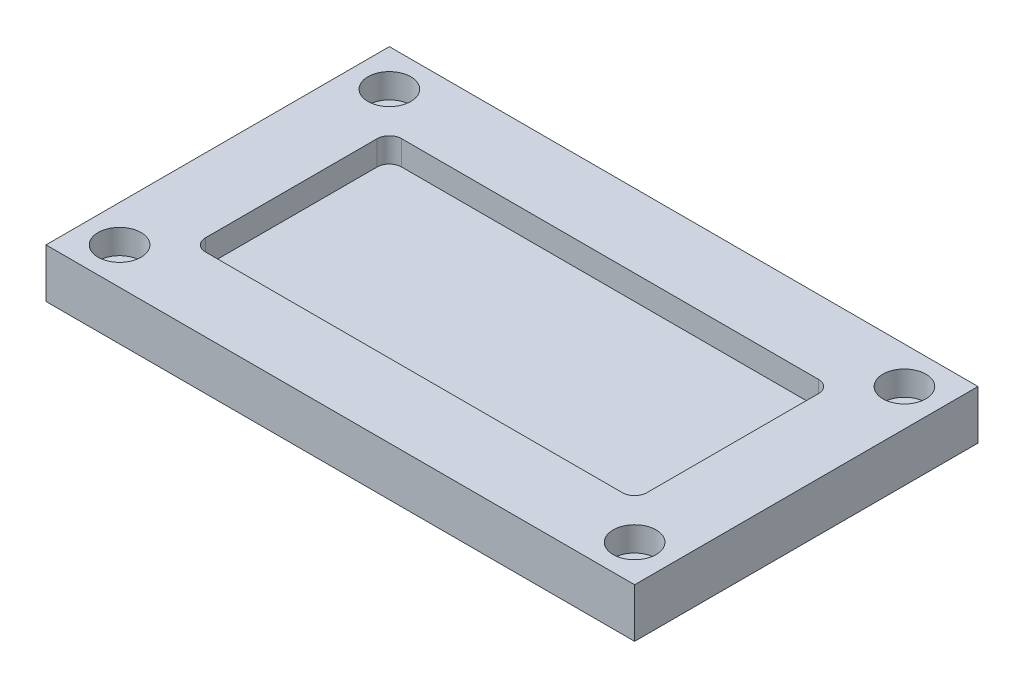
ISO-10303-21;
HEADER;
FILE_DESCRIPTION(('STEP AP214'),'2;1');
FILE_NAME('part.step','',(''),(''),'','','');
FILE_SCHEMA(('AUTOMOTIVE_DESIGN { 1 0 10303 214 1 1 1 1 }'));
ENDSEC;
DATA;
#1=APPLICATION_CONTEXT('core data for automotive mechanical design processes');
#2=APPLICATION_PROTOCOL_DEFINITION('international standard','automotive_design',2000,#1);
#3=PRODUCT_CONTEXT('',#1,'mechanical');
#4=PRODUCT('Part','Part','',(#3));
#5=PRODUCT_RELATED_PRODUCT_CATEGORY('part','',(#4));
#6=PRODUCT_DEFINITION_FORMATION('','',#4);
#7=PRODUCT_DEFINITION_CONTEXT('part definition',#1,'design');
#8=PRODUCT_DEFINITION('design','',#6,#7);
#9=PRODUCT_DEFINITION_SHAPE('','',#8);
#10=(LENGTH_UNIT() NAMED_UNIT(*) SI_UNIT(.MILLI.,.METRE.));
#11=(NAMED_UNIT(*) PLANE_ANGLE_UNIT() SI_UNIT($,.RADIAN.));
#12=(NAMED_UNIT(*) SI_UNIT($,.STERADIAN.) SOLID_ANGLE_UNIT());
#13=UNCERTAINTY_MEASURE_WITH_UNIT(LENGTH_MEASURE(1.E-05),#10,'distance_accuracy_value','');
#14=(GEOMETRIC_REPRESENTATION_CONTEXT(3) GLOBAL_UNCERTAINTY_ASSIGNED_CONTEXT((#13)) GLOBAL_UNIT_ASSIGNED_CONTEXT((#10,
#11,#12)) REPRESENTATION_CONTEXT('',''));
#15=CARTESIAN_POINT('',(0.,0.,0.));
#16=DIRECTION('',(0.,0.,1.));
#17=DIRECTION('',(1.,0.,0.));
#18=AXIS2_PLACEMENT_3D('',#15,#16,#17);
#19=CARTESIAN_POINT('',(0.,0.,0.));
#20=DIRECTION('',(0.,1.,0.));
#21=DIRECTION('',(0.,0.,1.));
#22=AXIS2_PLACEMENT_3D('',#19,#20,#21);
#23=PLANE('',#22);
#24=CARTESIAN_POINT('',(-66.675,0.,-34.925));
#25=DIRECTION('',(0.,1.,0.));
#26=DIRECTION('',(0.,0.,1.));
#27=AXIS2_PLACEMENT_3D('',#24,#25,#26);
#28=CIRCLE('',#27,5.55625);
#29=CARTESIAN_POINT('',(-66.675,0.,-29.36875));
#30=VERTEX_POINT('',#29);
#31=EDGE_CURVE('E257',#30,#30,#28,.T.);
#32=ORIENTED_EDGE('',*,*,#31,.F.);
#33=EDGE_LOOP('',(#32));
#34=FACE_BOUND('',#33,.T.);
#35=CARTESIAN_POINT('',(-66.675,0.,34.925));
#36=DIRECTION('',(0.,1.,0.));
#37=DIRECTION('',(0.,0.,1.));
#38=AXIS2_PLACEMENT_3D('',#35,#36,#37);
#39=CIRCLE('',#38,5.55625);
#40=CARTESIAN_POINT('',(-66.675,0.,40.48125));
#41=VERTEX_POINT('',#40);
#42=EDGE_CURVE('E275',#41,#41,#39,.T.);
#43=ORIENTED_EDGE('',*,*,#42,.F.);
#44=EDGE_LOOP('',(#43));
#45=FACE_BOUND('',#44,.T.);
#46=CARTESIAN_POINT('',(66.675,0.,34.925));
#47=DIRECTION('',(0.,1.,0.));
#48=DIRECTION('',(0.,0.,1.));
#49=AXIS2_PLACEMENT_3D('',#46,#47,#48);
#50=CIRCLE('',#49,5.55625);
#51=CARTESIAN_POINT('',(66.675,0.,40.48125));
#52=VERTEX_POINT('',#51);
#53=EDGE_CURVE('E306',#52,#52,#50,.T.);
#54=ORIENTED_EDGE('',*,*,#53,.F.);
#55=EDGE_LOOP('',(#54));
#56=FACE_BOUND('',#55,.T.);
#57=CARTESIAN_POINT('',(66.675,0.,-34.925));
#58=DIRECTION('',(0.,1.,0.));
#59=DIRECTION('',(0.,0.,1.));
#60=AXIS2_PLACEMENT_3D('',#57,#58,#59);
#61=CIRCLE('',#60,5.55625);
#62=CARTESIAN_POINT('',(66.675,0.,-29.36875));
#63=VERTEX_POINT('',#62);
#64=EDGE_CURVE('E293',#63,#63,#61,.T.);
#65=ORIENTED_EDGE('',*,*,#64,.F.);
#66=EDGE_LOOP('',(#65));
#67=FACE_BOUND('',#66,.T.);
#68=DIRECTION('',(1.,0.,0.));
#69=VECTOR('',#68,1.);
#70=CARTESIAN_POINT('',(-76.2,0.,44.45));
#71=LINE('',#70,#69);
#72=CARTESIAN_POINT('',(-76.2,0.,44.45));
#73=VERTEX_POINT('',#72);
#74=CARTESIAN_POINT('',(76.2,0.,44.45));
#75=VERTEX_POINT('',#74);
#76=EDGE_CURVE('E166',#73,#75,#71,.T.);
#77=ORIENTED_EDGE('',*,*,#76,.T.);
#78=DIRECTION('',(0.,0.,-1.));
#79=VECTOR('',#78,1.);
#80=CARTESIAN_POINT('',(76.2,0.,44.45));
#81=LINE('',#80,#79);
#82=CARTESIAN_POINT('',(76.2,0.,-44.45));
#83=VERTEX_POINT('',#82);
#84=EDGE_CURVE('E136',#75,#83,#81,.T.);
#85=ORIENTED_EDGE('',*,*,#84,.T.);
#86=DIRECTION('',(1.,0.,0.));
#87=VECTOR('',#86,1.);
#88=CARTESIAN_POINT('',(-76.2,0.,-44.45));
#89=LINE('',#88,#87);
#90=CARTESIAN_POINT('',(-76.2,0.,-44.45));
#91=VERTEX_POINT('',#90);
#92=EDGE_CURVE('E157',#91,#83,#89,.T.);
#93=ORIENTED_EDGE('',*,*,#92,.F.);
#94=DIRECTION('',(0.,0.,-1.));
#95=VECTOR('',#94,1.);
#96=CARTESIAN_POINT('',(-76.2,0.,44.45));
#97=LINE('',#96,#95);
#98=EDGE_CURVE('E155',#73,#91,#97,.T.);
#99=ORIENTED_EDGE('',*,*,#98,.F.);
#100=EDGE_LOOP('',(#77,#85,#93,#99));
#101=FACE_BOUND('',#100,.T.);
#102=DIRECTION('',(1.,0.,0.));
#103=VECTOR('',#102,1.);
#104=CARTESIAN_POINT('',(-57.15,0.,25.4));
#105=LINE('',#104,#103);
#106=CARTESIAN_POINT('',(-53.975,0.,25.4));
#107=VERTEX_POINT('',#106);
#108=CARTESIAN_POINT('',(53.975,0.,25.4));
#109=VERTEX_POINT('',#108);
#110=EDGE_CURVE('E160',#107,#109,#105,.T.);
#111=ORIENTED_EDGE('',*,*,#110,.F.);
#112=CARTESIAN_POINT('',(-53.975,0.,22.225));
#113=DIRECTION('',(0.,1.,0.));
#114=DIRECTION('',(0.,0.,1.));
#115=AXIS2_PLACEMENT_3D('',#112,#113,#114);
#116=CIRCLE('',#115,3.175);
#117=CARTESIAN_POINT('',(-57.15,0.,22.225));
#118=VERTEX_POINT('',#117);
#119=EDGE_CURVE('E51',#107,#118,#116,.F.);
#120=ORIENTED_EDGE('',*,*,#119,.T.);
#121=DIRECTION('',(0.,0.,-1.));
#122=VECTOR('',#121,1.);
#123=CARTESIAN_POINT('',(-57.15,0.,25.4));
#124=LINE('',#123,#122);
#125=CARTESIAN_POINT('',(-57.15,0.,-22.225));
#126=VERTEX_POINT('',#125);
#127=EDGE_CURVE('E191',#118,#126,#124,.T.);
#128=ORIENTED_EDGE('',*,*,#127,.T.);
#129=CARTESIAN_POINT('',(-53.975,0.,-22.225));
#130=DIRECTION('',(0.,1.,0.));
#131=DIRECTION('',(0.,0.,1.));
#132=AXIS2_PLACEMENT_3D('',#129,#130,#131);
#133=CIRCLE('',#132,3.175);
#134=CARTESIAN_POINT('',(-53.975,0.,-25.4));
#135=VERTEX_POINT('',#134);
#136=EDGE_CURVE('E12',#126,#135,#133,.F.);
#137=ORIENTED_EDGE('',*,*,#136,.T.);
#138=DIRECTION('',(1.,0.,0.));
#139=VECTOR('',#138,1.);
#140=CARTESIAN_POINT('',(-57.15,0.,-25.4));
#141=LINE('',#140,#139);
#142=CARTESIAN_POINT('',(53.975,0.,-25.4));
#143=VERTEX_POINT('',#142);
#144=EDGE_CURVE('E187',#135,#143,#141,.T.);
#145=ORIENTED_EDGE('',*,*,#144,.T.);
#146=CARTESIAN_POINT('',(53.975,0.,-22.225));
#147=DIRECTION('',(0.,1.,0.));
#148=DIRECTION('',(0.,0.,1.));
#149=AXIS2_PLACEMENT_3D('',#146,#147,#148);
#150=CIRCLE('',#149,3.175);
#151=CARTESIAN_POINT('',(57.15,0.,-22.225));
#152=VERTEX_POINT('',#151);
#153=EDGE_CURVE('E385',#143,#152,#150,.F.);
#154=ORIENTED_EDGE('',*,*,#153,.T.);
#155=DIRECTION('',(0.,0.,-1.));
#156=VECTOR('',#155,1.);
#157=CARTESIAN_POINT('',(57.15,0.,25.4));
#158=LINE('',#157,#156);
#159=CARTESIAN_POINT('',(57.15,0.,22.225));
#160=VERTEX_POINT('',#159);
#161=EDGE_CURVE('E184',#160,#152,#158,.T.);
#162=ORIENTED_EDGE('',*,*,#161,.F.);
#163=CARTESIAN_POINT('',(53.975,0.,22.225));
#164=DIRECTION('',(0.,1.,0.));
#165=DIRECTION('',(0.,0.,1.));
#166=AXIS2_PLACEMENT_3D('',#163,#164,#165);
#167=CIRCLE('',#166,3.175);
#168=EDGE_CURVE('E327',#160,#109,#167,.F.);
#169=ORIENTED_EDGE('',*,*,#168,.T.);
#170=EDGE_LOOP('',(#111,#120,#128,#137,#145,#154,#162,#169));
#171=FACE_BOUND('',#170,.T.);
#172=ADVANCED_FACE('F43',(#34,#45,#56,#67,#101,#171),#23,.T.);
#173=CARTESIAN_POINT('',(-76.2,-12.7,44.45));
#174=DIRECTION('',(0.,0.,1.));
#175=DIRECTION('',(1.,0.,0.));
#176=AXIS2_PLACEMENT_3D('',#173,#174,#175);
#177=PLANE('',#176);
#178=ORIENTED_EDGE('',*,*,#76,.F.);
#179=DIRECTION('',(0.,1.,0.));
#180=VECTOR('',#179,1.);
#181=CARTESIAN_POINT('',(-76.2,-12.7,44.45));
#182=LINE('',#181,#180);
#183=CARTESIAN_POINT('',(-76.2,-12.7,44.45));
#184=VERTEX_POINT('',#183);
#185=EDGE_CURVE('E153',#184,#73,#182,.T.);
#186=ORIENTED_EDGE('',*,*,#185,.F.);
#187=DIRECTION('',(1.,0.,0.));
#188=VECTOR('',#187,1.);
#189=CARTESIAN_POINT('',(-76.2,-12.7,44.45));
#190=LINE('',#189,#188);
#191=CARTESIAN_POINT('',(76.2,-12.7,44.45));
#192=VERTEX_POINT('',#191);
#193=EDGE_CURVE('E147',#184,#192,#190,.T.);
#194=ORIENTED_EDGE('',*,*,#193,.T.);
#195=DIRECTION('',(0.,1.,0.));
#196=VECTOR('',#195,1.);
#197=CARTESIAN_POINT('',(76.2,-12.7,44.45));
#198=LINE('',#197,#196);
#199=EDGE_CURVE('E131',#192,#75,#198,.T.);
#200=ORIENTED_EDGE('',*,*,#199,.T.);
#201=EDGE_LOOP('',(#178,#186,#194,#200));
#202=FACE_BOUND('',#201,.T.);
#203=ADVANCED_FACE('F152',(#202),#177,.T.);
#204=CARTESIAN_POINT('',(-76.2,-12.7,44.45));
#205=DIRECTION('',(1.,0.,0.));
#206=DIRECTION('',(0.,0.,-1.));
#207=AXIS2_PLACEMENT_3D('',#204,#205,#206);
#208=PLANE('',#207);
#209=ORIENTED_EDGE('',*,*,#98,.T.);
#210=DIRECTION('',(0.,1.,0.));
#211=VECTOR('',#210,1.);
#212=CARTESIAN_POINT('',(-76.2,-12.7,-44.45));
#213=LINE('',#212,#211);
#214=CARTESIAN_POINT('',(-76.2,-12.7,-44.45));
#215=VERTEX_POINT('',#214);
#216=EDGE_CURVE('E176',#215,#91,#213,.T.);
#217=ORIENTED_EDGE('',*,*,#216,.F.);
#218=DIRECTION('',(0.,0.,-1.));
#219=VECTOR('',#218,1.);
#220=CARTESIAN_POINT('',(-76.2,-12.7,44.45));
#221=LINE('',#220,#219);
#222=EDGE_CURVE('E142',#184,#215,#221,.T.);
#223=ORIENTED_EDGE('',*,*,#222,.F.);
#224=ORIENTED_EDGE('',*,*,#185,.T.);
#225=EDGE_LOOP('',(#209,#217,#223,#224));
#226=FACE_BOUND('',#225,.T.);
#227=ADVANCED_FACE('F353',(#226),#208,.F.);
#228=CARTESIAN_POINT('',(-76.2,-12.7,-44.45));
#229=DIRECTION('',(0.,0.,1.));
#230=DIRECTION('',(1.,0.,0.));
#231=AXIS2_PLACEMENT_3D('',#228,#229,#230);
#232=PLANE('',#231);
#233=ORIENTED_EDGE('',*,*,#92,.T.);
#234=DIRECTION('',(0.,1.,0.));
#235=VECTOR('',#234,1.);
#236=CARTESIAN_POINT('',(76.2,-12.7,-44.45));
#237=LINE('',#236,#235);
#238=CARTESIAN_POINT('',(76.2,-12.7,-44.45));
#239=VERTEX_POINT('',#238);
#240=EDGE_CURVE('E141',#239,#83,#237,.T.);
#241=ORIENTED_EDGE('',*,*,#240,.F.);
#242=DIRECTION('',(1.,0.,0.));
#243=VECTOR('',#242,1.);
#244=CARTESIAN_POINT('',(-76.2,-12.7,-44.45));
#245=LINE('',#244,#243);
#246=EDGE_CURVE('E149',#215,#239,#245,.T.);
#247=ORIENTED_EDGE('',*,*,#246,.F.);
#248=ORIENTED_EDGE('',*,*,#216,.T.);
#249=EDGE_LOOP('',(#233,#241,#247,#248));
#250=FACE_BOUND('',#249,.T.);
#251=ADVANCED_FACE('F351',(#250),#232,.F.);
#252=CARTESIAN_POINT('',(76.2,-12.7,44.45));
#253=DIRECTION('',(1.,0.,0.));
#254=DIRECTION('',(0.,0.,-1.));
#255=AXIS2_PLACEMENT_3D('',#252,#253,#254);
#256=PLANE('',#255);
#257=ORIENTED_EDGE('',*,*,#84,.F.);
#258=ORIENTED_EDGE('',*,*,#199,.F.);
#259=DIRECTION('',(0.,0.,-1.));
#260=VECTOR('',#259,1.);
#261=CARTESIAN_POINT('',(76.2,-12.7,44.45));
#262=LINE('',#261,#260);
#263=EDGE_CURVE('E134',#192,#239,#262,.T.);
#264=ORIENTED_EDGE('',*,*,#263,.T.);
#265=ORIENTED_EDGE('',*,*,#240,.T.);
#266=EDGE_LOOP('',(#257,#258,#264,#265));
#267=FACE_BOUND('',#266,.T.);
#268=ADVANCED_FACE('F133',(#267),#256,.T.);
#269=CARTESIAN_POINT('',(0.,-12.7,0.));
#270=DIRECTION('',(0.,1.,0.));
#271=DIRECTION('',(0.,0.,1.));
#272=AXIS2_PLACEMENT_3D('',#269,#270,#271);
#273=PLANE('',#272);
#274=CARTESIAN_POINT('',(-66.675,-12.7,-34.925));
#275=DIRECTION('',(0.,1.,0.));
#276=DIRECTION('',(0.,0.,1.));
#277=AXIS2_PLACEMENT_3D('',#274,#275,#276);
#278=CIRCLE('',#277,3.3782);
#279=CARTESIAN_POINT('',(-66.675,-12.7,-31.5468));
#280=VERTEX_POINT('',#279);
#281=EDGE_CURVE('E262',#280,#280,#278,.T.);
#282=ORIENTED_EDGE('',*,*,#281,.T.);
#283=EDGE_LOOP('',(#282));
#284=FACE_BOUND('',#283,.T.);
#285=CARTESIAN_POINT('',(-66.675,-12.7,34.925));
#286=DIRECTION('',(0.,1.,0.));
#287=DIRECTION('',(0.,0.,1.));
#288=AXIS2_PLACEMENT_3D('',#285,#286,#287);
#289=CIRCLE('',#288,3.3782);
#290=CARTESIAN_POINT('',(-66.675,-12.7,38.3032));
#291=VERTEX_POINT('',#290);
#292=EDGE_CURVE('E280',#291,#291,#289,.T.);
#293=ORIENTED_EDGE('',*,*,#292,.T.);
#294=EDGE_LOOP('',(#293));
#295=FACE_BOUND('',#294,.T.);
#296=CARTESIAN_POINT('',(66.675,-12.7,34.925));
#297=DIRECTION('',(0.,1.,0.));
#298=DIRECTION('',(0.,0.,1.));
#299=AXIS2_PLACEMENT_3D('',#296,#297,#298);
#300=CIRCLE('',#299,3.3782);
#301=CARTESIAN_POINT('',(66.675,-12.7,38.3032));
#302=VERTEX_POINT('',#301);
#303=EDGE_CURVE('E310',#302,#302,#300,.T.);
#304=ORIENTED_EDGE('',*,*,#303,.T.);
#305=EDGE_LOOP('',(#304));
#306=FACE_BOUND('',#305,.T.);
#307=CARTESIAN_POINT('',(66.675,-12.7,-34.925));
#308=DIRECTION('',(0.,1.,0.));
#309=DIRECTION('',(0.,0.,1.));
#310=AXIS2_PLACEMENT_3D('',#307,#308,#309);
#311=CIRCLE('',#310,3.3782);
#312=CARTESIAN_POINT('',(66.675,-12.7,-31.5468));
#313=VERTEX_POINT('',#312);
#314=EDGE_CURVE('E194',#313,#313,#311,.T.);
#315=ORIENTED_EDGE('',*,*,#314,.T.);
#316=EDGE_LOOP('',(#315));
#317=FACE_BOUND('',#316,.T.);
#318=ORIENTED_EDGE('',*,*,#193,.F.);
#319=ORIENTED_EDGE('',*,*,#222,.T.);
#320=ORIENTED_EDGE('',*,*,#246,.T.);
#321=ORIENTED_EDGE('',*,*,#263,.F.);
#322=EDGE_LOOP('',(#318,#319,#320,#321));
#323=FACE_BOUND('',#322,.T.);
#324=ADVANCED_FACE('F146',(#284,#295,#306,#317,#323),#273,.F.);
#325=CARTESIAN_POINT('',(-57.15,-6.35,25.4));
#326=DIRECTION('',(1.,0.,0.));
#327=DIRECTION('',(0.,0.,-1.));
#328=AXIS2_PLACEMENT_3D('',#325,#326,#327);
#329=PLANE('',#328);
#330=ORIENTED_EDGE('',*,*,#127,.F.);
#331=DIRECTION('',(0.,1.,0.));
#332=VECTOR('',#331,1.);
#333=CARTESIAN_POINT('',(-57.15,-6.35,22.225));
#334=LINE('',#333,#332);
#335=CARTESIAN_POINT('',(-57.15,-6.35,22.225));
#336=VERTEX_POINT('',#335);
#337=EDGE_CURVE('E379',#118,#336,#334,.F.);
#338=ORIENTED_EDGE('',*,*,#337,.T.);
#339=DIRECTION('',(0.,0.,-1.));
#340=VECTOR('',#339,1.);
#341=CARTESIAN_POINT('',(-57.15,-6.35,25.4));
#342=LINE('',#341,#340);
#343=CARTESIAN_POINT('',(-57.15,-6.35,-22.225));
#344=VERTEX_POINT('',#343);
#345=EDGE_CURVE('E209',#336,#344,#342,.T.);
#346=ORIENTED_EDGE('',*,*,#345,.T.);
#347=DIRECTION('',(0.,1.,0.));
#348=VECTOR('',#347,1.);
#349=CARTESIAN_POINT('',(-57.15,0.,-22.225));
#350=LINE('',#349,#348);
#351=EDGE_CURVE('E243',#344,#126,#350,.T.);
#352=ORIENTED_EDGE('',*,*,#351,.T.);
#353=EDGE_LOOP('',(#330,#338,#346,#352));
#354=FACE_BOUND('',#353,.T.);
#355=ADVANCED_FACE('F384',(#354),#329,.T.);
#356=CARTESIAN_POINT('',(-57.15,-6.35,-25.4));
#357=DIRECTION('',(0.,0.,1.));
#358=DIRECTION('',(1.,0.,0.));
#359=AXIS2_PLACEMENT_3D('',#356,#357,#358);
#360=PLANE('',#359);
#361=DIRECTION('',(1.,0.,0.));
#362=VECTOR('',#361,1.);
#363=CARTESIAN_POINT('',(-57.15,-6.35,-25.4));
#364=LINE('',#363,#362);
#365=CARTESIAN_POINT('',(-53.975,-6.35,-25.4));
#366=VERTEX_POINT('',#365);
#367=CARTESIAN_POINT('',(53.975,-6.35,-25.4));
#368=VERTEX_POINT('',#367);
#369=EDGE_CURVE('E205',#366,#368,#364,.T.);
#370=ORIENTED_EDGE('',*,*,#369,.T.);
#371=DIRECTION('',(0.,1.,0.));
#372=VECTOR('',#371,1.);
#373=CARTESIAN_POINT('',(53.975,-6.35,-25.4));
#374=LINE('',#373,#372);
#375=EDGE_CURVE('E239',#368,#143,#374,.T.);
#376=ORIENTED_EDGE('',*,*,#375,.T.);
#377=ORIENTED_EDGE('',*,*,#144,.F.);
#378=DIRECTION('',(0.,1.,0.));
#379=VECTOR('',#378,1.);
#380=CARTESIAN_POINT('',(-53.975,-6.35,-25.4));
#381=LINE('',#380,#379);
#382=EDGE_CURVE('E237',#135,#366,#381,.F.);
#383=ORIENTED_EDGE('',*,*,#382,.T.);
#384=EDGE_LOOP('',(#370,#376,#377,#383));
#385=FACE_BOUND('',#384,.T.);
#386=ADVANCED_FACE('F391',(#385),#360,.T.);
#387=CARTESIAN_POINT('',(57.15,-6.35,25.4));
#388=DIRECTION('',(1.,0.,0.));
#389=DIRECTION('',(0.,0.,-1.));
#390=AXIS2_PLACEMENT_3D('',#387,#388,#389);
#391=PLANE('',#390);
#392=DIRECTION('',(0.,0.,-1.));
#393=VECTOR('',#392,1.);
#394=CARTESIAN_POINT('',(57.15,-6.35,25.4));
#395=LINE('',#394,#393);
#396=CARTESIAN_POINT('',(57.15,-6.35,22.225));
#397=VERTEX_POINT('',#396);
#398=CARTESIAN_POINT('',(57.15,-6.35,-22.225));
#399=VERTEX_POINT('',#398);
#400=EDGE_CURVE('E202',#397,#399,#395,.T.);
#401=ORIENTED_EDGE('',*,*,#400,.F.);
#402=DIRECTION('',(0.,1.,0.));
#403=VECTOR('',#402,1.);
#404=CARTESIAN_POINT('',(57.15,0.,22.225));
#405=LINE('',#404,#403);
#406=EDGE_CURVE('E225',#397,#160,#405,.T.);
#407=ORIENTED_EDGE('',*,*,#406,.T.);
#408=ORIENTED_EDGE('',*,*,#161,.T.);
#409=DIRECTION('',(0.,1.,0.));
#410=VECTOR('',#409,1.);
#411=CARTESIAN_POINT('',(57.15,-6.35,-22.225));
#412=LINE('',#411,#410);
#413=EDGE_CURVE('E175',#152,#399,#412,.F.);
#414=ORIENTED_EDGE('',*,*,#413,.T.);
#415=EDGE_LOOP('',(#401,#407,#408,#414));
#416=FACE_BOUND('',#415,.T.);
#417=ADVANCED_FACE('F344',(#416),#391,.F.);
#418=CARTESIAN_POINT('',(-57.15,-6.35,25.4));
#419=DIRECTION('',(0.,0.,1.));
#420=DIRECTION('',(1.,0.,0.));
#421=AXIS2_PLACEMENT_3D('',#418,#419,#420);
#422=PLANE('',#421);
#423=ORIENTED_EDGE('',*,*,#110,.T.);
#424=DIRECTION('',(0.,1.,0.));
#425=VECTOR('',#424,1.);
#426=CARTESIAN_POINT('',(53.975,-6.35,25.4));
#427=LINE('',#426,#425);
#428=CARTESIAN_POINT('',(53.975,-6.35,25.4));
#429=VERTEX_POINT('',#428);
#430=EDGE_CURVE('E224',#109,#429,#427,.F.);
#431=ORIENTED_EDGE('',*,*,#430,.T.);
#432=DIRECTION('',(1.,0.,0.));
#433=VECTOR('',#432,1.);
#434=CARTESIAN_POINT('',(-57.15,-6.35,25.4));
#435=LINE('',#434,#433);
#436=CARTESIAN_POINT('',(-53.975,-6.35,25.4));
#437=VERTEX_POINT('',#436);
#438=EDGE_CURVE('E168',#437,#429,#435,.T.);
#439=ORIENTED_EDGE('',*,*,#438,.F.);
#440=DIRECTION('',(0.,1.,0.));
#441=VECTOR('',#440,1.);
#442=CARTESIAN_POINT('',(-53.975,-6.35,25.4));
#443=LINE('',#442,#441);
#444=EDGE_CURVE('E220',#437,#107,#443,.T.);
#445=ORIENTED_EDGE('',*,*,#444,.T.);
#446=EDGE_LOOP('',(#423,#431,#439,#445));
#447=FACE_BOUND('',#446,.T.);
#448=ADVANCED_FACE('F330',(#447),#422,.F.);
#449=CARTESIAN_POINT('',(0.,-6.35,0.));
#450=DIRECTION('',(0.,-1.,0.));
#451=DIRECTION('',(0.,0.,-1.));
#452=AXIS2_PLACEMENT_3D('',#449,#450,#451);
#453=PLANE('',#452);
#454=ORIENTED_EDGE('',*,*,#438,.T.);
#455=CARTESIAN_POINT('',(53.975,-6.35,22.225));
#456=DIRECTION('',(0.,-1.,0.));
#457=DIRECTION('',(0.,0.,-1.));
#458=AXIS2_PLACEMENT_3D('',#455,#456,#457);
#459=CIRCLE('',#458,3.175);
#460=EDGE_CURVE('E235',#429,#397,#459,.F.);
#461=ORIENTED_EDGE('',*,*,#460,.T.);
#462=ORIENTED_EDGE('',*,*,#400,.T.);
#463=CARTESIAN_POINT('',(53.975,-6.35,-22.225));
#464=DIRECTION('',(0.,-1.,0.));
#465=DIRECTION('',(0.,0.,-1.));
#466=AXIS2_PLACEMENT_3D('',#463,#464,#465);
#467=CIRCLE('',#466,3.175);
#468=EDGE_CURVE('E233',#399,#368,#467,.F.);
#469=ORIENTED_EDGE('',*,*,#468,.T.);
#470=ORIENTED_EDGE('',*,*,#369,.F.);
#471=CARTESIAN_POINT('',(-53.975,-6.35,-22.225));
#472=DIRECTION('',(0.,-1.,0.));
#473=DIRECTION('',(0.,0.,-1.));
#474=AXIS2_PLACEMENT_3D('',#471,#472,#473);
#475=CIRCLE('',#474,3.175);
#476=EDGE_CURVE('E229',#366,#344,#475,.F.);
#477=ORIENTED_EDGE('',*,*,#476,.T.);
#478=ORIENTED_EDGE('',*,*,#345,.F.);
#479=CARTESIAN_POINT('',(-53.975,-6.35,22.225));
#480=DIRECTION('',(0.,-1.,0.));
#481=DIRECTION('',(0.,0.,-1.));
#482=AXIS2_PLACEMENT_3D('',#479,#480,#481);
#483=CIRCLE('',#482,3.175);
#484=EDGE_CURVE('E231',#336,#437,#483,.F.);
#485=ORIENTED_EDGE('',*,*,#484,.T.);
#486=EDGE_LOOP('',(#454,#461,#462,#469,#470,#477,#478,#485));
#487=FACE_BOUND('',#486,.T.);
#488=ADVANCED_FACE('F341',(#487),#453,.F.);
#489=CARTESIAN_POINT('',(66.675,0.,-34.925));
#490=DIRECTION('',(0.,1.,0.));
#491=DIRECTION('',(0.,0.,1.));
#492=AXIS2_PLACEMENT_3D('',#489,#490,#491);
#493=CYLINDRICAL_SURFACE('',#492,3.3782);
#494=ORIENTED_EDGE('',*,*,#314,.F.);
#495=EDGE_LOOP('',(#494));
#496=FACE_BOUND('',#495,.T.);
#497=CARTESIAN_POINT('',(66.675,-6.35,-34.925));
#498=DIRECTION('',(0.,1.,0.));
#499=DIRECTION('',(0.,0.,1.));
#500=AXIS2_PLACEMENT_3D('',#497,#498,#499);
#501=CIRCLE('',#500,3.3782);
#502=CARTESIAN_POINT('',(66.675,-6.35,-31.5468));
#503=VERTEX_POINT('',#502);
#504=EDGE_CURVE('E292',#503,#503,#501,.T.);
#505=ORIENTED_EDGE('',*,*,#504,.T.);
#506=EDGE_LOOP('',(#505));
#507=FACE_BOUND('',#506,.T.);
#508=ADVANCED_FACE('F414',(#496,#507),#493,.F.);
#509=CARTESIAN_POINT('',(70.0532,-6.35,-34.925));
#510=DIRECTION('',(0.,-1.,0.));
#511=DIRECTION('',(0.,0.,-1.));
#512=AXIS2_PLACEMENT_3D('',#509,#510,#511);
#513=PLANE('',#512);
#514=ORIENTED_EDGE('',*,*,#504,.F.);
#515=EDGE_LOOP('',(#514));
#516=FACE_BOUND('',#515,.T.);
#517=CARTESIAN_POINT('',(66.675,-6.35,-34.925));
#518=DIRECTION('',(0.,1.,0.));
#519=DIRECTION('',(0.,0.,1.));
#520=AXIS2_PLACEMENT_3D('',#517,#518,#519);
#521=CIRCLE('',#520,5.55625);
#522=CARTESIAN_POINT('',(66.675,-6.35,-29.36875));
#523=VERTEX_POINT('',#522);
#524=EDGE_CURVE('E289',#523,#523,#521,.T.);
#525=ORIENTED_EDGE('',*,*,#524,.T.);
#526=EDGE_LOOP('',(#525));
#527=FACE_BOUND('',#526,.T.);
#528=ADVANCED_FACE('F417',(#516,#527),#513,.F.);
#529=CARTESIAN_POINT('',(66.675,0.,-34.925));
#530=DIRECTION('',(0.,1.,0.));
#531=DIRECTION('',(0.,0.,1.));
#532=AXIS2_PLACEMENT_3D('',#529,#530,#531);
#533=CYLINDRICAL_SURFACE('',#532,5.55625);
#534=ORIENTED_EDGE('',*,*,#524,.F.);
#535=EDGE_LOOP('',(#534));
#536=FACE_BOUND('',#535,.T.);
#537=ORIENTED_EDGE('',*,*,#64,.T.);
#538=EDGE_LOOP('',(#537));
#539=FACE_BOUND('',#538,.T.);
#540=ADVANCED_FACE('F318',(#536,#539),#533,.F.);
#541=CARTESIAN_POINT('',(66.675,0.,34.925));
#542=DIRECTION('',(0.,1.,0.));
#543=DIRECTION('',(0.,0.,1.));
#544=AXIS2_PLACEMENT_3D('',#541,#542,#543);
#545=CYLINDRICAL_SURFACE('',#544,3.3782);
#546=ORIENTED_EDGE('',*,*,#303,.F.);
#547=EDGE_LOOP('',(#546));
#548=FACE_BOUND('',#547,.T.);
#549=CARTESIAN_POINT('',(66.675,-6.35,34.925));
#550=DIRECTION('',(0.,1.,0.));
#551=DIRECTION('',(0.,0.,1.));
#552=AXIS2_PLACEMENT_3D('',#549,#550,#551);
#553=CIRCLE('',#552,3.3782);
#554=CARTESIAN_POINT('',(66.675,-6.35,38.3032));
#555=VERTEX_POINT('',#554);
#556=EDGE_CURVE('E305',#555,#555,#553,.T.);
#557=ORIENTED_EDGE('',*,*,#556,.T.);
#558=EDGE_LOOP('',(#557));
#559=FACE_BOUND('',#558,.T.);
#560=ADVANCED_FACE('F427',(#548,#559),#545,.F.);
#561=CARTESIAN_POINT('',(70.0532,-6.35,34.925));
#562=DIRECTION('',(0.,-1.,0.));
#563=DIRECTION('',(0.,0.,-1.));
#564=AXIS2_PLACEMENT_3D('',#561,#562,#563);
#565=PLANE('',#564);
#566=ORIENTED_EDGE('',*,*,#556,.F.);
#567=EDGE_LOOP('',(#566));
#568=FACE_BOUND('',#567,.T.);
#569=CARTESIAN_POINT('',(66.675,-6.35,34.925));
#570=DIRECTION('',(0.,1.,0.));
#571=DIRECTION('',(0.,0.,1.));
#572=AXIS2_PLACEMENT_3D('',#569,#570,#571);
#573=CIRCLE('',#572,5.55625);
#574=CARTESIAN_POINT('',(66.675,-6.35,40.48125));
#575=VERTEX_POINT('',#574);
#576=EDGE_CURVE('E302',#575,#575,#573,.T.);
#577=ORIENTED_EDGE('',*,*,#576,.T.);
#578=EDGE_LOOP('',(#577));
#579=FACE_BOUND('',#578,.T.);
#580=ADVANCED_FACE('F432',(#568,#579),#565,.F.);
#581=CARTESIAN_POINT('',(66.675,0.,34.925));
#582=DIRECTION('',(0.,1.,0.));
#583=DIRECTION('',(0.,0.,1.));
#584=AXIS2_PLACEMENT_3D('',#581,#582,#583);
#585=CYLINDRICAL_SURFACE('',#584,5.55625);
#586=ORIENTED_EDGE('',*,*,#576,.F.);
#587=EDGE_LOOP('',(#586));
#588=FACE_BOUND('',#587,.T.);
#589=ORIENTED_EDGE('',*,*,#53,.T.);
#590=EDGE_LOOP('',(#589));
#591=FACE_BOUND('',#590,.T.);
#592=ADVANCED_FACE('F514',(#588,#591),#585,.F.);
#593=CARTESIAN_POINT('',(-66.675,0.,34.925));
#594=DIRECTION('',(0.,1.,0.));
#595=DIRECTION('',(0.,0.,1.));
#596=AXIS2_PLACEMENT_3D('',#593,#594,#595);
#597=CYLINDRICAL_SURFACE('',#596,3.3782);
#598=ORIENTED_EDGE('',*,*,#292,.F.);
#599=EDGE_LOOP('',(#598));
#600=FACE_BOUND('',#599,.T.);
#601=CARTESIAN_POINT('',(-66.675,-6.35,34.925));
#602=DIRECTION('',(0.,1.,0.));
#603=DIRECTION('',(0.,0.,1.));
#604=AXIS2_PLACEMENT_3D('',#601,#602,#603);
#605=CIRCLE('',#604,3.3782);
#606=CARTESIAN_POINT('',(-66.675,-6.35,38.3032));
#607=VERTEX_POINT('',#606);
#608=EDGE_CURVE('E274',#607,#607,#605,.T.);
#609=ORIENTED_EDGE('',*,*,#608,.T.);
#610=EDGE_LOOP('',(#609));
#611=FACE_BOUND('',#610,.T.);
#612=ADVANCED_FACE('F524',(#600,#611),#597,.F.);
#613=CARTESIAN_POINT('',(-63.2968,-6.35,34.925));
#614=DIRECTION('',(0.,-1.,0.));
#615=DIRECTION('',(0.,0.,-1.));
#616=AXIS2_PLACEMENT_3D('',#613,#614,#615);
#617=PLANE('',#616);
#618=ORIENTED_EDGE('',*,*,#608,.F.);
#619=EDGE_LOOP('',(#618));
#620=FACE_BOUND('',#619,.T.);
#621=CARTESIAN_POINT('',(-66.675,-6.35,34.925));
#622=DIRECTION('',(0.,1.,0.));
#623=DIRECTION('',(0.,0.,1.));
#624=AXIS2_PLACEMENT_3D('',#621,#622,#623);
#625=CIRCLE('',#624,5.55625);
#626=CARTESIAN_POINT('',(-66.675,-6.35,40.48125));
#627=VERTEX_POINT('',#626);
#628=EDGE_CURVE('E270',#627,#627,#625,.T.);
#629=ORIENTED_EDGE('',*,*,#628,.T.);
#630=EDGE_LOOP('',(#629));
#631=FACE_BOUND('',#630,.T.);
#632=ADVANCED_FACE('F536',(#620,#631),#617,.F.);
#633=CARTESIAN_POINT('',(-66.675,0.,34.925));
#634=DIRECTION('',(0.,1.,0.));
#635=DIRECTION('',(0.,0.,1.));
#636=AXIS2_PLACEMENT_3D('',#633,#634,#635);
#637=CYLINDRICAL_SURFACE('',#636,5.55625);
#638=ORIENTED_EDGE('',*,*,#628,.F.);
#639=EDGE_LOOP('',(#638));
#640=FACE_BOUND('',#639,.T.);
#641=ORIENTED_EDGE('',*,*,#42,.T.);
#642=EDGE_LOOP('',(#641));
#643=FACE_BOUND('',#642,.T.);
#644=ADVANCED_FACE('F548',(#640,#643),#637,.F.);
#645=CARTESIAN_POINT('',(-66.675,0.,-34.925));
#646=DIRECTION('',(0.,1.,0.));
#647=DIRECTION('',(0.,0.,1.));
#648=AXIS2_PLACEMENT_3D('',#645,#646,#647);
#649=CYLINDRICAL_SURFACE('',#648,3.3782);
#650=ORIENTED_EDGE('',*,*,#281,.F.);
#651=EDGE_LOOP('',(#650));
#652=FACE_BOUND('',#651,.T.);
#653=CARTESIAN_POINT('',(-66.675,-6.35,-34.925));
#654=DIRECTION('',(0.,1.,0.));
#655=DIRECTION('',(0.,0.,1.));
#656=AXIS2_PLACEMENT_3D('',#653,#654,#655);
#657=CIRCLE('',#656,3.3782);
#658=CARTESIAN_POINT('',(-66.675,-6.35,-31.5468));
#659=VERTEX_POINT('',#658);
#660=EDGE_CURVE('E256',#659,#659,#657,.T.);
#661=ORIENTED_EDGE('',*,*,#660,.T.);
#662=EDGE_LOOP('',(#661));
#663=FACE_BOUND('',#662,.T.);
#664=ADVANCED_FACE('F560',(#652,#663),#649,.F.);
#665=CARTESIAN_POINT('',(-63.2968,-6.35,-34.925));
#666=DIRECTION('',(0.,-1.,0.));
#667=DIRECTION('',(0.,0.,-1.));
#668=AXIS2_PLACEMENT_3D('',#665,#666,#667);
#669=PLANE('',#668);
#670=ORIENTED_EDGE('',*,*,#660,.F.);
#671=EDGE_LOOP('',(#670));
#672=FACE_BOUND('',#671,.T.);
#673=CARTESIAN_POINT('',(-66.675,-6.35,-34.925));
#674=DIRECTION('',(0.,1.,0.));
#675=DIRECTION('',(0.,0.,1.));
#676=AXIS2_PLACEMENT_3D('',#673,#674,#675);
#677=CIRCLE('',#676,5.55625);
#678=CARTESIAN_POINT('',(-66.675,-6.35,-29.36875));
#679=VERTEX_POINT('',#678);
#680=EDGE_CURVE('E252',#679,#679,#677,.T.);
#681=ORIENTED_EDGE('',*,*,#680,.T.);
#682=EDGE_LOOP('',(#681));
#683=FACE_BOUND('',#682,.T.);
#684=ADVANCED_FACE('F572',(#672,#683),#669,.F.);
#685=CARTESIAN_POINT('',(-66.675,0.,-34.925));
#686=DIRECTION('',(0.,1.,0.));
#687=DIRECTION('',(0.,0.,1.));
#688=AXIS2_PLACEMENT_3D('',#685,#686,#687);
#689=CYLINDRICAL_SURFACE('',#688,5.55625);
#690=ORIENTED_EDGE('',*,*,#680,.F.);
#691=EDGE_LOOP('',(#690));
#692=FACE_BOUND('',#691,.T.);
#693=ORIENTED_EDGE('',*,*,#31,.T.);
#694=EDGE_LOOP('',(#693));
#695=FACE_BOUND('',#694,.T.);
#696=ADVANCED_FACE('F369',(#692,#695),#689,.F.);
#697=CARTESIAN_POINT('',(53.975,-6.35,22.225));
#698=DIRECTION('',(0.,-1.,0.));
#699=DIRECTION('',(0.,0.,-1.));
#700=AXIS2_PLACEMENT_3D('',#697,#698,#699);
#701=CYLINDRICAL_SURFACE('',#700,3.175);
#702=ORIENTED_EDGE('',*,*,#460,.F.);
#703=ORIENTED_EDGE('',*,*,#430,.F.);
#704=ORIENTED_EDGE('',*,*,#168,.F.);
#705=ORIENTED_EDGE('',*,*,#406,.F.);
#706=EDGE_LOOP('',(#702,#703,#704,#705));
#707=FACE_BOUND('',#706,.T.);
#708=ADVANCED_FACE('F336',(#707),#701,.F.);
#709=CARTESIAN_POINT('',(53.975,-6.35,-22.225));
#710=DIRECTION('',(0.,1.,0.));
#711=DIRECTION('',(0.,0.,1.));
#712=AXIS2_PLACEMENT_3D('',#709,#710,#711);
#713=CYLINDRICAL_SURFACE('',#712,3.175);
#714=ORIENTED_EDGE('',*,*,#468,.F.);
#715=ORIENTED_EDGE('',*,*,#413,.F.);
#716=ORIENTED_EDGE('',*,*,#153,.F.);
#717=ORIENTED_EDGE('',*,*,#375,.F.);
#718=EDGE_LOOP('',(#714,#715,#716,#717));
#719=FACE_BOUND('',#718,.T.);
#720=ADVANCED_FACE('F368',(#719),#713,.F.);
#721=CARTESIAN_POINT('',(-53.975,-6.35,22.225));
#722=DIRECTION('',(0.,1.,0.));
#723=DIRECTION('',(0.,0.,1.));
#724=AXIS2_PLACEMENT_3D('',#721,#722,#723);
#725=CYLINDRICAL_SURFACE('',#724,3.175);
#726=ORIENTED_EDGE('',*,*,#484,.F.);
#727=ORIENTED_EDGE('',*,*,#337,.F.);
#728=ORIENTED_EDGE('',*,*,#119,.F.);
#729=ORIENTED_EDGE('',*,*,#444,.F.);
#730=EDGE_LOOP('',(#726,#727,#728,#729));
#731=FACE_BOUND('',#730,.T.);
#732=ADVANCED_FACE('F371',(#731),#725,.F.);
#733=CARTESIAN_POINT('',(-53.975,-6.35,-22.225));
#734=DIRECTION('',(0.,-1.,0.));
#735=DIRECTION('',(0.,0.,-1.));
#736=AXIS2_PLACEMENT_3D('',#733,#734,#735);
#737=CYLINDRICAL_SURFACE('',#736,3.175);
#738=ORIENTED_EDGE('',*,*,#476,.F.);
#739=ORIENTED_EDGE('',*,*,#382,.F.);
#740=ORIENTED_EDGE('',*,*,#136,.F.);
#741=ORIENTED_EDGE('',*,*,#351,.F.);
#742=EDGE_LOOP('',(#738,#739,#740,#741));
#743=FACE_BOUND('',#742,.T.);
#744=ADVANCED_FACE('F45',(#743),#737,.F.);
#745=CLOSED_SHELL('',(#172,#203,#227,#251,#268,#324,#355,#386,#417,#448,#488,#508,#528,#540,
#560,#580,#592,#612,#632,#644,#664,#684,#696,#708,#720,#732,#744));
#746=MANIFOLD_SOLID_BREP('B2',#745);
#747=ADVANCED_BREP_SHAPE_REPRESENTATION('',(#18,#746),#14);
#748=SHAPE_DEFINITION_REPRESENTATION(#9,#747);
ENDSEC;
END-ISO-10303-21;
